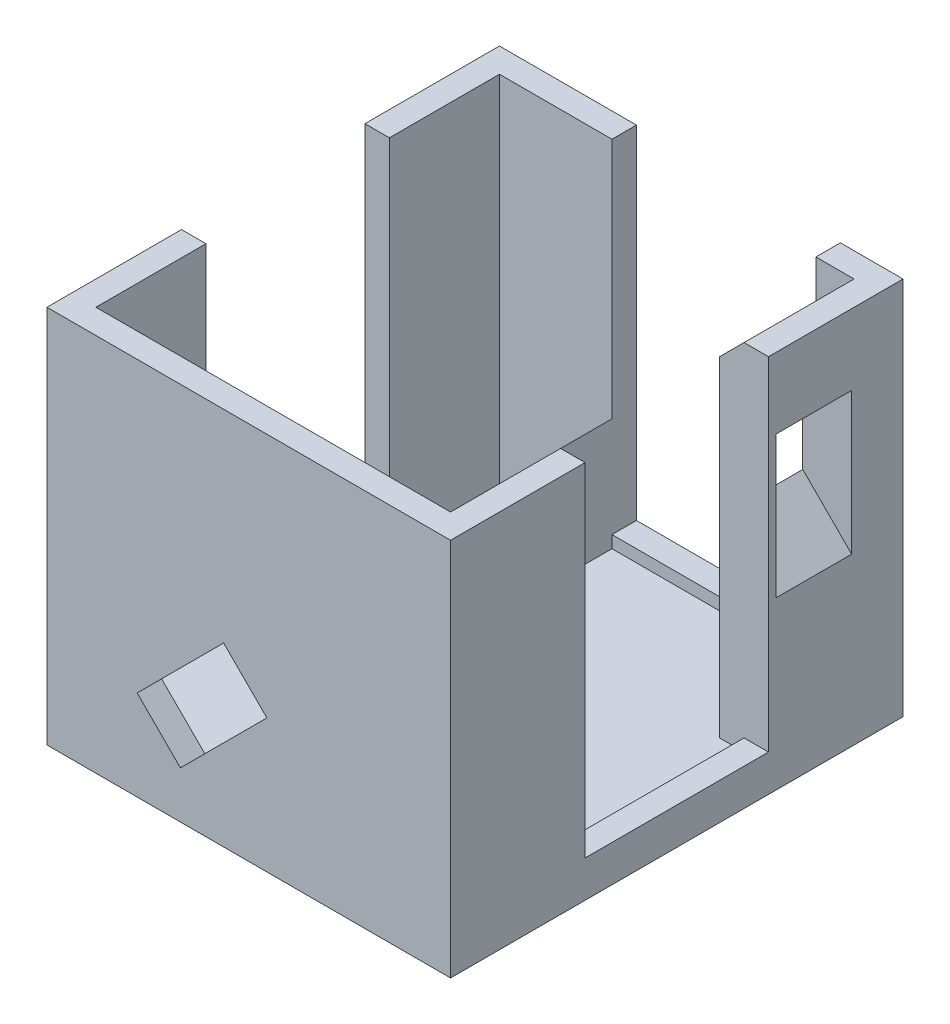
ISO-10303-21;
HEADER;
FILE_DESCRIPTION(('STEP AP214'),'2;1');
FILE_NAME('part.step','',(''),(''),'','','');
FILE_SCHEMA(('AUTOMOTIVE_DESIGN { 1 0 10303 214 1 1 1 1 }'));
ENDSEC;
DATA;
#1=APPLICATION_CONTEXT('core data for automotive mechanical design processes');
#2=APPLICATION_PROTOCOL_DEFINITION('international standard','automotive_design',2000,#1);
#3=PRODUCT_CONTEXT('',#1,'mechanical');
#4=PRODUCT('Part','Part','',(#3));
#5=PRODUCT_RELATED_PRODUCT_CATEGORY('part','',(#4));
#6=PRODUCT_DEFINITION_FORMATION('','',#4);
#7=PRODUCT_DEFINITION_CONTEXT('part definition',#1,'design');
#8=PRODUCT_DEFINITION('design','',#6,#7);
#9=PRODUCT_DEFINITION_SHAPE('','',#8);
#10=(LENGTH_UNIT() NAMED_UNIT(*) SI_UNIT(.MILLI.,.METRE.));
#11=(NAMED_UNIT(*) PLANE_ANGLE_UNIT() SI_UNIT($,.RADIAN.));
#12=(NAMED_UNIT(*) SI_UNIT($,.STERADIAN.) SOLID_ANGLE_UNIT());
#13=UNCERTAINTY_MEASURE_WITH_UNIT(LENGTH_MEASURE(1.E-05),#10,'distance_accuracy_value','');
#14=(GEOMETRIC_REPRESENTATION_CONTEXT(3) GLOBAL_UNCERTAINTY_ASSIGNED_CONTEXT((#13)) GLOBAL_UNIT_ASSIGNED_CONTEXT((#10,
#11,#12)) REPRESENTATION_CONTEXT('',''));
#15=CARTESIAN_POINT('',(0.,0.,0.));
#16=DIRECTION('',(0.,0.,1.));
#17=DIRECTION('',(1.,0.,0.));
#18=AXIS2_PLACEMENT_3D('',#15,#16,#17);
#19=CARTESIAN_POINT('',(0.,58.,0.));
#20=DIRECTION('',(0.,1.,0.));
#21=DIRECTION('',(0.,0.,1.));
#22=AXIS2_PLACEMENT_3D('',#19,#20,#21);
#23=PLANE('',#22);
#24=DIRECTION('',(0.,0.,1.));
#25=VECTOR('',#24,1.);
#26=CARTESIAN_POINT('',(-10.6,58.,-33.));
#27=LINE('',#26,#25);
#28=CARTESIAN_POINT('',(-10.6,58.,-37.));
#29=VERTEX_POINT('',#28);
#30=CARTESIAN_POINT('',(-10.6,58.,-33.));
#31=VERTEX_POINT('',#30);
#32=EDGE_CURVE('E646',#29,#31,#27,.T.);
#33=ORIENTED_EDGE('',*,*,#32,.F.);
#34=DIRECTION('',(-1.,0.,0.));
#35=VECTOR('',#34,1.);
#36=CARTESIAN_POINT('',(-33.,58.,-37.));
#37=LINE('',#36,#35);
#38=CARTESIAN_POINT('',(-33.,58.,-37.));
#39=VERTEX_POINT('',#38);
#40=EDGE_CURVE('E542',#29,#39,#37,.T.);
#41=ORIENTED_EDGE('',*,*,#40,.T.);
#42=DIRECTION('',(0.,0.,1.));
#43=VECTOR('',#42,1.);
#44=CARTESIAN_POINT('',(-33.,58.,-37.));
#45=LINE('',#44,#43);
#46=CARTESIAN_POINT('',(-33.,58.,-15.));
#47=VERTEX_POINT('',#46);
#48=EDGE_CURVE('E548',#39,#47,#45,.T.);
#49=ORIENTED_EDGE('',*,*,#48,.T.);
#50=DIRECTION('',(-1.,0.,0.));
#51=VECTOR('',#50,1.);
#52=CARTESIAN_POINT('',(-29.,58.,-15.));
#53=LINE('',#52,#51);
#54=CARTESIAN_POINT('',(-29.,58.,-15.));
#55=VERTEX_POINT('',#54);
#56=EDGE_CURVE('E690',#55,#47,#53,.T.);
#57=ORIENTED_EDGE('',*,*,#56,.F.);
#58=DIRECTION('',(0.,0.,1.));
#59=VECTOR('',#58,1.);
#60=CARTESIAN_POINT('',(-29.,58.,-33.));
#61=LINE('',#60,#59);
#62=CARTESIAN_POINT('',(-29.,58.,-33.));
#63=VERTEX_POINT('',#62);
#64=EDGE_CURVE('E518',#63,#55,#61,.T.);
#65=ORIENTED_EDGE('',*,*,#64,.F.);
#66=DIRECTION('',(-1.,0.,0.));
#67=VECTOR('',#66,1.);
#68=CARTESIAN_POINT('',(-29.,58.,-33.));
#69=LINE('',#68,#67);
#70=EDGE_CURVE('E512',#31,#63,#69,.T.);
#71=ORIENTED_EDGE('',*,*,#70,.F.);
#72=EDGE_LOOP('',(#33,#41,#49,#57,#65,#71));
#73=FACE_BOUND('',#72,.T.);
#74=ADVANCED_FACE('F45',(#73),#23,.T.);
#75=CARTESIAN_POINT('',(-29.,58.,-33.));
#76=DIRECTION('',(0.,0.,1.));
#77=DIRECTION('',(1.,0.,0.));
#78=AXIS2_PLACEMENT_3D('',#75,#76,#77);
#79=PLANE('',#78);
#80=DIRECTION('',(0.,1.,0.));
#81=VECTOR('',#80,1.);
#82=CARTESIAN_POINT('',(-10.6,2.,-33.));
#83=LINE('',#82,#81);
#84=CARTESIAN_POINT('',(-10.6,18.4000000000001,-33.));
#85=VERTEX_POINT('',#84);
#86=EDGE_CURVE('E817',#85,#31,#83,.T.);
#87=ORIENTED_EDGE('',*,*,#86,.T.);
#88=ORIENTED_EDGE('',*,*,#70,.T.);
#89=DIRECTION('',(0.,-1.,0.));
#90=VECTOR('',#89,1.);
#91=CARTESIAN_POINT('',(-29.,58.,-33.));
#92=LINE('',#91,#90);
#93=CARTESIAN_POINT('',(-29.,0.,-33.));
#94=VERTEX_POINT('',#93);
#95=EDGE_CURVE('E533',#63,#94,#92,.T.);
#96=ORIENTED_EDGE('',*,*,#95,.T.);
#97=DIRECTION('',(-0.707106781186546,-0.707106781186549,0.));
#98=VECTOR('',#97,1.);
#99=CARTESIAN_POINT('',(-29.,0.,-33.));
#100=LINE('',#99,#98);
#101=EDGE_CURVE('E480',#85,#94,#100,.T.);
#102=ORIENTED_EDGE('',*,*,#101,.F.);
#103=EDGE_LOOP('',(#87,#88,#96,#102));
#104=FACE_BOUND('',#103,.T.);
#105=ADVANCED_FACE('F615',(#104),#79,.T.);
#106=CARTESIAN_POINT('',(0.,-4.,0.));
#107=DIRECTION('',(0.,1.,0.));
#108=DIRECTION('',(0.,0.,1.));
#109=AXIS2_PLACEMENT_3D('',#106,#107,#108);
#110=PLANE('',#109);
#111=DIRECTION('',(0.,0.,1.));
#112=VECTOR('',#111,1.);
#113=CARTESIAN_POINT('',(33.,-4.,-37.));
#114=LINE('',#113,#112);
#115=CARTESIAN_POINT('',(33.,-4.,-37.));
#116=VERTEX_POINT('',#115);
#117=CARTESIAN_POINT('',(33.,-4.,37.));
#118=VERTEX_POINT('',#117);
#119=EDGE_CURVE('E490',#116,#118,#114,.T.);
#120=ORIENTED_EDGE('',*,*,#119,.T.);
#121=DIRECTION('',(-1.,0.,0.));
#122=VECTOR('',#121,1.);
#123=CARTESIAN_POINT('',(-33.,-4.,37.));
#124=LINE('',#123,#122);
#125=CARTESIAN_POINT('',(-33.,-4.,37.));
#126=VERTEX_POINT('',#125);
#127=EDGE_CURVE('E495',#118,#126,#124,.T.);
#128=ORIENTED_EDGE('',*,*,#127,.T.);
#129=DIRECTION('',(0.,0.,-1.));
#130=VECTOR('',#129,1.);
#131=CARTESIAN_POINT('',(-33.,-4.,-37.));
#132=LINE('',#131,#130);
#133=CARTESIAN_POINT('',(-33.,-4.,-37.));
#134=VERTEX_POINT('',#133);
#135=EDGE_CURVE('E499',#126,#134,#132,.T.);
#136=ORIENTED_EDGE('',*,*,#135,.T.);
#137=DIRECTION('',(1.,0.,0.));
#138=VECTOR('',#137,1.);
#139=CARTESIAN_POINT('',(-33.,-4.,-37.));
#140=LINE('',#139,#138);
#141=EDGE_CURVE('E503',#134,#116,#140,.T.);
#142=ORIENTED_EDGE('',*,*,#141,.T.);
#143=EDGE_LOOP('',(#120,#128,#136,#142));
#144=FACE_BOUND('',#143,.T.);
#145=CARTESIAN_POINT('',(0.,-4.,0.));
#146=DIRECTION('',(0.,1.,0.));
#147=DIRECTION('',(0.,0.,1.));
#148=AXIS2_PLACEMENT_3D('',#145,#146,#147);
#149=CIRCLE('',#148,2.75);
#150=CARTESIAN_POINT('',(2.23,-4.,-1.60922341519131));
#151=VERTEX_POINT('',#150);
#152=CARTESIAN_POINT('',(2.23,-4.,1.60922341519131));
#153=VERTEX_POINT('',#152);
#154=EDGE_CURVE('E61',#151,#153,#149,.T.);
#155=ORIENTED_EDGE('',*,*,#154,.T.);
#156=DIRECTION('',(0.,0.,-1.));
#157=VECTOR('',#156,1.);
#158=CARTESIAN_POINT('',(2.23,-4.,1.60922341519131));
#159=LINE('',#158,#157);
#160=EDGE_CURVE('E810',#153,#151,#159,.T.);
#161=ORIENTED_EDGE('',*,*,#160,.T.);
#162=EDGE_LOOP('',(#155,#161));
#163=FACE_BOUND('',#162,.T.);
#164=ADVANCED_FACE('F621',(#144,#163),#110,.F.);
#165=CARTESIAN_POINT('',(0.,18.4,0.));
#166=DIRECTION('',(0.,1.,0.));
#167=DIRECTION('',(0.,0.,1.));
#168=AXIS2_PLACEMENT_3D('',#165,#166,#167);
#169=PLANE('',#168);
#170=CARTESIAN_POINT('',(0.,18.4,0.));
#171=DIRECTION('',(0.,1.,0.));
#172=DIRECTION('',(0.,0.,1.));
#173=AXIS2_PLACEMENT_3D('',#170,#171,#172);
#174=CIRCLE('',#173,10.);
#175=CARTESIAN_POINT('',(0.,18.4,10.));
#176=VERTEX_POINT('',#175);
#177=EDGE_CURVE('E772',#176,#176,#174,.T.);
#178=ORIENTED_EDGE('',*,*,#177,.T.);
#179=EDGE_LOOP('',(#178));
#180=FACE_BOUND('',#179,.T.);
#181=DIRECTION('',(0.,0.,-1.));
#182=VECTOR('',#181,1.);
#183=CARTESIAN_POINT('',(2.23,18.4,1.60922341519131));
#184=LINE('',#183,#182);
#185=CARTESIAN_POINT('',(2.23,18.4,1.60922341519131));
#186=VERTEX_POINT('',#185);
#187=CARTESIAN_POINT('',(2.23,18.4,-1.60922341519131));
#188=VERTEX_POINT('',#187);
#189=EDGE_CURVE('E802',#186,#188,#184,.T.);
#190=ORIENTED_EDGE('',*,*,#189,.F.);
#191=CARTESIAN_POINT('',(0.,18.4,0.));
#192=DIRECTION('',(0.,1.,0.));
#193=DIRECTION('',(0.,0.,1.));
#194=AXIS2_PLACEMENT_3D('',#191,#192,#193);
#195=CIRCLE('',#194,2.75);
#196=EDGE_CURVE('E807',#188,#186,#195,.T.);
#197=ORIENTED_EDGE('',*,*,#196,.F.);
#198=EDGE_LOOP('',(#190,#197));
#199=FACE_BOUND('',#198,.T.);
#200=ADVANCED_FACE('F628',(#180,#199),#169,.T.);
#201=DIRECTION('',(0.,0.,-1.));
#202=VECTOR('',#201,1.);
#203=CARTESIAN_POINT('',(22.7548995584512,58.,-33.));
#204=LINE('',#203,#202);
#205=CARTESIAN_POINT('',(22.7548995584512,58.,-33.));
#206=VERTEX_POINT('',#205);
#207=CARTESIAN_POINT('',(22.7548995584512,58.,-37.));
#208=VERTEX_POINT('',#207);
#209=EDGE_CURVE('E316',#206,#208,#204,.T.);
#210=ORIENTED_EDGE('',*,*,#209,.F.);
#211=CARTESIAN_POINT('',(29.,58.,-33.));
#212=VERTEX_POINT('',#211);
#213=EDGE_CURVE('E514',#212,#206,#69,.T.);
#214=ORIENTED_EDGE('',*,*,#213,.F.);
#215=DIRECTION('',(0.,0.,-1.));
#216=VECTOR('',#215,1.);
#217=CARTESIAN_POINT('',(29.,58.,-33.));
#218=LINE('',#217,#216);
#219=CARTESIAN_POINT('',(29.,58.,-15.));
#220=VERTEX_POINT('',#219);
#221=EDGE_CURVE('E513',#220,#212,#218,.T.);
#222=ORIENTED_EDGE('',*,*,#221,.F.);
#223=DIRECTION('',(-1.,0.,0.));
#224=VECTOR('',#223,1.);
#225=CARTESIAN_POINT('',(29.,58.,-15.));
#226=LINE('',#225,#224);
#227=CARTESIAN_POINT('',(33.,58.,-15.));
#228=VERTEX_POINT('',#227);
#229=EDGE_CURVE('E767',#228,#220,#226,.T.);
#230=ORIENTED_EDGE('',*,*,#229,.F.);
#231=DIRECTION('',(0.,0.,-1.));
#232=VECTOR('',#231,1.);
#233=CARTESIAN_POINT('',(33.,58.,-37.));
#234=LINE('',#233,#232);
#235=CARTESIAN_POINT('',(33.,58.,-37.));
#236=VERTEX_POINT('',#235);
#237=EDGE_CURVE('E537',#228,#236,#234,.T.);
#238=ORIENTED_EDGE('',*,*,#237,.T.);
#239=EDGE_CURVE('E543',#236,#208,#37,.T.);
#240=ORIENTED_EDGE('',*,*,#239,.T.);
#241=EDGE_LOOP('',(#210,#214,#222,#230,#238,#240));
#242=FACE_BOUND('',#241,.T.);
#243=ADVANCED_FACE('F612',(#242),#23,.T.);
#244=CARTESIAN_POINT('',(-29.,0.,-33.));
#245=DIRECTION('',(-0.707106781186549,0.707106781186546,0.));
#246=DIRECTION('',(-0.707106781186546,-0.707106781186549,0.));
#247=AXIS2_PLACEMENT_3D('',#244,#245,#246);
#248=PLANE('',#247);
#249=DIRECTION('',(0.,0.,-1.));
#250=VECTOR('',#249,1.);
#251=CARTESIAN_POINT('',(-26.2,2.8,-33.));
#252=LINE('',#251,#250);
#253=CARTESIAN_POINT('',(-26.2,2.8,33.));
#254=VERTEX_POINT('',#253);
#255=CARTESIAN_POINT('',(-26.2,2.8,27.));
#256=VERTEX_POINT('',#255);
#257=EDGE_CURVE('E385',#254,#256,#252,.T.);
#258=ORIENTED_EDGE('',*,*,#257,.T.);
#259=DIRECTION('',(-0.707106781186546,-0.707106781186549,0.));
#260=VECTOR('',#259,1.);
#261=CARTESIAN_POINT('',(-29.,0.,27.));
#262=LINE('',#261,#260);
#263=CARTESIAN_POINT('',(-29.,0.,27.));
#264=VERTEX_POINT('',#263);
#265=EDGE_CURVE('E393',#256,#264,#262,.T.);
#266=ORIENTED_EDGE('',*,*,#265,.T.);
#267=DIRECTION('',(0.,0.,1.));
#268=VECTOR('',#267,1.);
#269=CARTESIAN_POINT('',(-29.,0.,-33.));
#270=LINE('',#269,#268);
#271=CARTESIAN_POINT('',(-29.,0.,33.));
#272=VERTEX_POINT('',#271);
#273=EDGE_CURVE('E507',#264,#272,#270,.T.);
#274=ORIENTED_EDGE('',*,*,#273,.T.);
#275=DIRECTION('',(0.707106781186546,0.707106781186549,0.));
#276=VECTOR('',#275,1.);
#277=CARTESIAN_POINT('',(0.,29.0000000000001,33.));
#278=LINE('',#277,#276);
#279=EDGE_CURVE('E486',#272,#254,#278,.T.);
#280=ORIENTED_EDGE('',*,*,#279,.T.);
#281=EDGE_LOOP('',(#258,#266,#274,#280));
#282=FACE_BOUND('',#281,.T.);
#283=ADVANCED_FACE('F627',(#282),#248,.T.);
#284=CARTESIAN_POINT('',(25.,54.0000000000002,-33.));
#285=VERTEX_POINT('',#284);
#286=EDGE_CURVE('E481',#212,#285,#100,.T.);
#287=ORIENTED_EDGE('',*,*,#286,.T.);
#288=DIRECTION('',(0.,0.,1.));
#289=VECTOR('',#288,1.);
#290=CARTESIAN_POINT('',(25.,54.0000000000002,-33.));
#291=LINE('',#290,#289);
#292=CARTESIAN_POINT('',(25.,54.0000000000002,-28.6));
#293=VERTEX_POINT('',#292);
#294=EDGE_CURVE('E381',#285,#293,#291,.T.);
#295=ORIENTED_EDGE('',*,*,#294,.T.);
#296=DIRECTION('',(-0.707106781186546,-0.707106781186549,0.));
#297=VECTOR('',#296,1.);
#298=CARTESIAN_POINT('',(25.2106282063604,54.2106282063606,-28.6));
#299=LINE('',#298,#297);
#300=CARTESIAN_POINT('',(25.2106282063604,54.2106282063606,-28.6));
#301=VERTEX_POINT('',#300);
#302=EDGE_CURVE('E445',#301,#293,#299,.T.);
#303=ORIENTED_EDGE('',*,*,#302,.F.);
#304=DIRECTION('',(0.,0.,-1.));
#305=VECTOR('',#304,1.);
#306=CARTESIAN_POINT('',(25.2106282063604,54.2106282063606,-28.6));
#307=LINE('',#306,#305);
#308=CARTESIAN_POINT('',(25.2106282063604,54.2106282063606,-16.2));
#309=VERTEX_POINT('',#308);
#310=EDGE_CURVE('E441',#309,#301,#307,.T.);
#311=ORIENTED_EDGE('',*,*,#310,.F.);
#312=DIRECTION('',(0.707106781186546,0.707106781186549,0.));
#313=VECTOR('',#312,1.);
#314=CARTESIAN_POINT('',(25.2106282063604,54.2106282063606,-16.2));
#315=LINE('',#314,#313);
#316=CARTESIAN_POINT('',(25.,54.0000000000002,-16.2));
#317=VERTEX_POINT('',#316);
#318=EDGE_CURVE('E438',#317,#309,#315,.T.);
#319=ORIENTED_EDGE('',*,*,#318,.F.);
#320=CARTESIAN_POINT('',(25.,54.0000000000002,-15.));
#321=VERTEX_POINT('',#320);
#322=EDGE_CURVE('E377',#317,#321,#291,.T.);
#323=ORIENTED_EDGE('',*,*,#322,.T.);
#324=DIRECTION('',(0.707106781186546,0.707106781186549,0.));
#325=VECTOR('',#324,1.);
#326=CARTESIAN_POINT('',(-29.,0.,-15.));
#327=LINE('',#326,#325);
#328=EDGE_CURVE('E401',#321,#220,#327,.T.);
#329=ORIENTED_EDGE('',*,*,#328,.T.);
#330=ORIENTED_EDGE('',*,*,#221,.T.);
#331=EDGE_LOOP('',(#287,#295,#303,#311,#319,#323,#329,#330));
#332=FACE_BOUND('',#331,.T.);
#333=ADVANCED_FACE('F580',(#332),#248,.T.);
#334=DIRECTION('',(0.707106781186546,0.707106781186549,0.));
#335=VECTOR('',#334,1.);
#336=CARTESIAN_POINT('',(-29.,0.,-21.));
#337=LINE('',#336,#335);
#338=CARTESIAN_POINT('',(-29.,0.,-21.));
#339=VERTEX_POINT('',#338);
#340=CARTESIAN_POINT('',(-10.6,18.4000000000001,-21.));
#341=VERTEX_POINT('',#340);
#342=EDGE_CURVE('E389',#339,#341,#337,.T.);
#343=ORIENTED_EDGE('',*,*,#342,.T.);
#344=DIRECTION('',(0.,0.,-1.));
#345=VECTOR('',#344,1.);
#346=CARTESIAN_POINT('',(-10.6,18.4000000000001,-33.));
#347=LINE('',#346,#345);
#348=EDGE_CURVE('E397',#341,#85,#347,.T.);
#349=ORIENTED_EDGE('',*,*,#348,.T.);
#350=ORIENTED_EDGE('',*,*,#101,.T.);
#351=EDGE_CURVE('E526',#94,#339,#270,.T.);
#352=ORIENTED_EDGE('',*,*,#351,.T.);
#353=EDGE_LOOP('',(#343,#349,#350,#352));
#354=FACE_BOUND('',#353,.T.);
#355=ADVANCED_FACE('F683',(#354),#248,.T.);
#356=CARTESIAN_POINT('',(46.4238316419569,32.9974247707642,-16.2));
#357=DIRECTION('',(0.,0.,1.));
#358=DIRECTION('',(0.,-1.,0.));
#359=AXIS2_PLACEMENT_3D('',#356,#357,#358);
#360=PLANE('',#359);
#361=DIRECTION('',(0.,-1.,0.));
#362=VECTOR('',#361,1.);
#363=CARTESIAN_POINT('',(25.,32.9974247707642,-16.2));
#364=LINE('',#363,#362);
#365=CARTESIAN_POINT('',(25.,31.2281539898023,-16.2));
#366=VERTEX_POINT('',#365);
#367=EDGE_CURVE('E374',#317,#366,#364,.T.);
#368=ORIENTED_EDGE('',*,*,#367,.F.);
#369=ORIENTED_EDGE('',*,*,#318,.T.);
#370=DIRECTION('',(-0.707106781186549,0.707106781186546,0.));
#371=VECTOR('',#370,1.);
#372=CARTESIAN_POINT('',(46.4238316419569,32.9974247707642,-16.2));
#373=LINE('',#372,#371);
#374=CARTESIAN_POINT('',(33.,46.421256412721,-16.2));
#375=VERTEX_POINT('',#374);
#376=EDGE_CURVE('E449',#375,#309,#373,.T.);
#377=ORIENTED_EDGE('',*,*,#376,.F.);
#378=DIRECTION('',(0.,1.,0.));
#379=VECTOR('',#378,1.);
#380=CARTESIAN_POINT('',(33.,58.,-16.2));
#381=LINE('',#380,#379);
#382=CARTESIAN_POINT('',(33.,23.2281539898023,-16.2));
#383=VERTEX_POINT('',#382);
#384=EDGE_CURVE('E476',#383,#375,#381,.T.);
#385=ORIENTED_EDGE('',*,*,#384,.F.);
#386=DIRECTION('',(-0.707106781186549,0.707106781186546,0.));
#387=VECTOR('',#386,1.);
#388=CARTESIAN_POINT('',(34.8272804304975,21.4008735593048,-16.2));
#389=LINE('',#388,#387);
#390=EDGE_CURVE('E450',#383,#366,#389,.T.);
#391=ORIENTED_EDGE('',*,*,#390,.T.);
#392=EDGE_LOOP('',(#368,#369,#377,#385,#391));
#393=FACE_BOUND('',#392,.T.);
#394=ADVANCED_FACE('F592',(#393),#360,.F.);
#395=CARTESIAN_POINT('',(34.8272804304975,21.4008735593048,-28.6));
#396=DIRECTION('',(-0.707106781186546,-0.707106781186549,0.));
#397=DIRECTION('',(0.707106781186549,-0.707106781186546,0.));
#398=AXIS2_PLACEMENT_3D('',#395,#396,#397);
#399=PLANE('',#398);
#400=DIRECTION('',(0.,0.,-1.));
#401=VECTOR('',#400,1.);
#402=CARTESIAN_POINT('',(25.,31.2281539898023,-28.6));
#403=LINE('',#402,#401);
#404=CARTESIAN_POINT('',(25.,31.2281539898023,-28.6));
#405=VERTEX_POINT('',#404);
#406=EDGE_CURVE('E371',#366,#405,#403,.T.);
#407=ORIENTED_EDGE('',*,*,#406,.F.);
#408=ORIENTED_EDGE('',*,*,#390,.F.);
#409=DIRECTION('',(0.,0.,1.));
#410=VECTOR('',#409,1.);
#411=CARTESIAN_POINT('',(33.,23.2281539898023,-37.));
#412=LINE('',#411,#410);
#413=CARTESIAN_POINT('',(33.,23.2281539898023,-28.6));
#414=VERTEX_POINT('',#413);
#415=EDGE_CURVE('E472',#414,#383,#412,.T.);
#416=ORIENTED_EDGE('',*,*,#415,.F.);
#417=DIRECTION('',(-0.707106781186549,0.707106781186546,0.));
#418=VECTOR('',#417,1.);
#419=CARTESIAN_POINT('',(34.8272804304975,21.4008735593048,-28.6));
#420=LINE('',#419,#418);
#421=EDGE_CURVE('E455',#414,#405,#420,.T.);
#422=ORIENTED_EDGE('',*,*,#421,.T.);
#423=EDGE_LOOP('',(#407,#408,#416,#422));
#424=FACE_BOUND('',#423,.T.);
#425=ADVANCED_FACE('F596',(#424),#399,.F.);
#426=CARTESIAN_POINT('',(46.4238316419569,32.9974247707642,-28.6));
#427=DIRECTION('',(0.,0.,-1.));
#428=DIRECTION('',(0.,1.,0.));
#429=AXIS2_PLACEMENT_3D('',#426,#427,#428);
#430=PLANE('',#429);
#431=DIRECTION('',(0.,1.,0.));
#432=VECTOR('',#431,1.);
#433=CARTESIAN_POINT('',(25.,32.9974247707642,-28.6));
#434=LINE('',#433,#432);
#435=EDGE_CURVE('E54',#405,#293,#434,.T.);
#436=ORIENTED_EDGE('',*,*,#435,.F.);
#437=ORIENTED_EDGE('',*,*,#421,.F.);
#438=DIRECTION('',(0.,-1.,0.));
#439=VECTOR('',#438,1.);
#440=CARTESIAN_POINT('',(33.,58.,-28.6));
#441=LINE('',#440,#439);
#442=CARTESIAN_POINT('',(33.,46.421256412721,-28.6));
#443=VERTEX_POINT('',#442);
#444=EDGE_CURVE('E468',#443,#414,#441,.T.);
#445=ORIENTED_EDGE('',*,*,#444,.F.);
#446=DIRECTION('',(-0.707106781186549,0.707106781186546,0.));
#447=VECTOR('',#446,1.);
#448=CARTESIAN_POINT('',(46.4238316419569,32.9974247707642,-28.6));
#449=LINE('',#448,#447);
#450=EDGE_CURVE('E459',#443,#301,#449,.T.);
#451=ORIENTED_EDGE('',*,*,#450,.T.);
#452=ORIENTED_EDGE('',*,*,#302,.T.);
#453=EDGE_LOOP('',(#436,#437,#445,#451,#452));
#454=FACE_BOUND('',#453,.T.);
#455=ADVANCED_FACE('F584',(#454),#430,.F.);
#456=CARTESIAN_POINT('',(-33.,58.,37.));
#457=DIRECTION('',(0.,0.,-1.));
#458=DIRECTION('',(-1.,0.,0.));
#459=AXIS2_PLACEMENT_3D('',#456,#457,#458);
#460=PLANE('',#459);
#461=DIRECTION('',(0.,-1.,0.));
#462=VECTOR('',#461,1.);
#463=CARTESIAN_POINT('',(33.,58.,37.));
#464=LINE('',#463,#462);
#465=CARTESIAN_POINT('',(33.,58.,37.));
#466=VERTEX_POINT('',#465);
#467=EDGE_CURVE('E555',#466,#118,#464,.T.);
#468=ORIENTED_EDGE('',*,*,#467,.F.);
#469=DIRECTION('',(1.,0.,0.));
#470=VECTOR('',#469,1.);
#471=CARTESIAN_POINT('',(-33.,58.,37.));
#472=LINE('',#471,#470);
#473=CARTESIAN_POINT('',(-33.,58.,37.));
#474=VERTEX_POINT('',#473);
#475=EDGE_CURVE('E552',#474,#466,#472,.T.);
#476=ORIENTED_EDGE('',*,*,#475,.F.);
#477=DIRECTION('',(0.,-1.,0.));
#478=VECTOR('',#477,1.);
#479=CARTESIAN_POINT('',(-33.,58.,37.));
#480=LINE('',#479,#478);
#481=EDGE_CURVE('E558',#474,#126,#480,.T.);
#482=ORIENTED_EDGE('',*,*,#481,.T.);
#483=ORIENTED_EDGE('',*,*,#127,.F.);
#484=EDGE_LOOP('',(#468,#476,#482,#483));
#485=FACE_BOUND('',#484,.T.);
#486=DIRECTION('',(0.707106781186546,0.707106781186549,0.));
#487=VECTOR('',#486,1.);
#488=CARTESIAN_POINT('',(-18.2519769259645,10.7480230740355,37.));
#489=LINE('',#488,#487);
#490=CARTESIAN_POINT('',(-18.2519769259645,10.7480230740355,37.));
#491=VERTEX_POINT('',#490);
#492=CARTESIAN_POINT('',(-4.10984130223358,24.8901586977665,37.));
#493=VERTEX_POINT('',#492);
#494=EDGE_CURVE('E409',#491,#493,#489,.T.);
#495=ORIENTED_EDGE('',*,*,#494,.T.);
#496=DIRECTION('',(0.707106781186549,-0.707106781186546,0.));
#497=VECTOR('',#496,1.);
#498=CARTESIAN_POINT('',(-4.10984130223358,24.8901586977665,37.));
#499=LINE('',#498,#497);
#500=CARTESIAN_POINT('',(2.96122650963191,17.8190908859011,37.));
#501=VERTEX_POINT('',#500);
#502=EDGE_CURVE('E413',#493,#501,#499,.T.);
#503=ORIENTED_EDGE('',*,*,#502,.T.);
#504=DIRECTION('',(0.707106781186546,0.707106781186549,0.));
#505=VECTOR('',#504,1.);
#506=CARTESIAN_POINT('',(-11.1809091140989,3.67695526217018,37.));
#507=LINE('',#506,#505);
#508=CARTESIAN_POINT('',(-11.1809091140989,3.67695526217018,37.));
#509=VERTEX_POINT('',#508);
#510=EDGE_CURVE('E417',#509,#501,#507,.T.);
#511=ORIENTED_EDGE('',*,*,#510,.F.);
#512=DIRECTION('',(0.707106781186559,-0.707106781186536,0.));
#513=VECTOR('',#512,1.);
#514=CARTESIAN_POINT('',(-18.2519769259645,10.7480230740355,37.));
#515=LINE('',#514,#513);
#516=EDGE_CURVE('E421',#491,#509,#515,.T.);
#517=ORIENTED_EDGE('',*,*,#516,.F.);
#518=EDGE_LOOP('',(#495,#503,#511,#517));
#519=FACE_BOUND('',#518,.T.);
#520=ADVANCED_FACE('F843',(#485,#519),#460,.F.);
#521=DIRECTION('',(0.,0.,-1.));
#522=VECTOR('',#521,1.);
#523=CARTESIAN_POINT('',(25.,54.0000000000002,-33.));
#524=LINE('',#523,#522);
#525=CARTESIAN_POINT('',(25.,54.0000000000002,33.));
#526=VERTEX_POINT('',#525);
#527=CARTESIAN_POINT('',(25.,54.0000000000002,15.));
#528=VERTEX_POINT('',#527);
#529=EDGE_CURVE('E382',#526,#528,#524,.T.);
#530=ORIENTED_EDGE('',*,*,#529,.F.);
#531=CARTESIAN_POINT('',(29.,58.,33.));
#532=VERTEX_POINT('',#531);
#533=EDGE_CURVE('E485',#526,#532,#278,.T.);
#534=ORIENTED_EDGE('',*,*,#533,.T.);
#535=CARTESIAN_POINT('',(29.,58.,15.));
#536=VERTEX_POINT('',#535);
#537=EDGE_CURVE('E508',#532,#536,#218,.T.);
#538=ORIENTED_EDGE('',*,*,#537,.T.);
#539=DIRECTION('',(0.707106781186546,0.707106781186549,0.));
#540=VECTOR('',#539,1.);
#541=CARTESIAN_POINT('',(-29.,0.,15.));
#542=LINE('',#541,#540);
#543=EDGE_CURVE('E405',#528,#536,#542,.T.);
#544=ORIENTED_EDGE('',*,*,#543,.F.);
#545=EDGE_LOOP('',(#530,#534,#538,#544));
#546=FACE_BOUND('',#545,.T.);
#547=ADVANCED_FACE('F609',(#546),#248,.T.);
#548=DIRECTION('',(1.,0.,0.));
#549=VECTOR('',#548,1.);
#550=CARTESIAN_POINT('',(33.,58.,15.));
#551=LINE('',#550,#549);
#552=CARTESIAN_POINT('',(33.,58.,15.));
#553=VERTEX_POINT('',#552);
#554=EDGE_CURVE('E700',#536,#553,#551,.T.);
#555=ORIENTED_EDGE('',*,*,#554,.F.);
#556=ORIENTED_EDGE('',*,*,#537,.F.);
#557=DIRECTION('',(1.,0.,0.));
#558=VECTOR('',#557,1.);
#559=CARTESIAN_POINT('',(-29.,58.,33.));
#560=LINE('',#559,#558);
#561=CARTESIAN_POINT('',(-29.,58.,33.));
#562=VERTEX_POINT('',#561);
#563=EDGE_CURVE('E522',#562,#532,#560,.T.);
#564=ORIENTED_EDGE('',*,*,#563,.F.);
#565=CARTESIAN_POINT('',(-29.,58.,15.));
#566=VERTEX_POINT('',#565);
#567=EDGE_CURVE('E517',#566,#562,#61,.T.);
#568=ORIENTED_EDGE('',*,*,#567,.F.);
#569=DIRECTION('',(1.,0.,0.));
#570=VECTOR('',#569,1.);
#571=CARTESIAN_POINT('',(-33.,58.,15.));
#572=LINE('',#571,#570);
#573=CARTESIAN_POINT('',(-33.,58.,15.));
#574=VERTEX_POINT('',#573);
#575=EDGE_CURVE('E695',#574,#566,#572,.T.);
#576=ORIENTED_EDGE('',*,*,#575,.F.);
#577=EDGE_CURVE('E547',#574,#474,#45,.T.);
#578=ORIENTED_EDGE('',*,*,#577,.T.);
#579=ORIENTED_EDGE('',*,*,#475,.T.);
#580=EDGE_CURVE('E538',#466,#553,#234,.T.);
#581=ORIENTED_EDGE('',*,*,#580,.T.);
#582=EDGE_LOOP('',(#555,#556,#564,#568,#576,#578,#579,#581));
#583=FACE_BOUND('',#582,.T.);
#584=ADVANCED_FACE('F600',(#583),#23,.T.);
#585=CARTESIAN_POINT('',(33.,58.,-37.));
#586=DIRECTION('',(-1.,0.,0.));
#587=DIRECTION('',(0.,0.,1.));
#588=AXIS2_PLACEMENT_3D('',#585,#586,#587);
#589=PLANE('',#588);
#590=ORIENTED_EDGE('',*,*,#237,.F.);
#591=DIRECTION('',(0.,1.,0.));
#592=VECTOR('',#591,1.);
#593=CARTESIAN_POINT('',(33.,2.,-15.));
#594=LINE('',#593,#592);
#595=CARTESIAN_POINT('',(33.,2.,-15.));
#596=VERTEX_POINT('',#595);
#597=EDGE_CURVE('E723',#596,#228,#594,.T.);
#598=ORIENTED_EDGE('',*,*,#597,.F.);
#599=DIRECTION('',(0.,0.,-1.));
#600=VECTOR('',#599,1.);
#601=CARTESIAN_POINT('',(33.,2.,-15.));
#602=LINE('',#601,#600);
#603=CARTESIAN_POINT('',(33.,2.,15.));
#604=VERTEX_POINT('',#603);
#605=EDGE_CURVE('E760',#604,#596,#602,.T.);
#606=ORIENTED_EDGE('',*,*,#605,.F.);
#607=DIRECTION('',(0.,1.,0.));
#608=VECTOR('',#607,1.);
#609=CARTESIAN_POINT('',(33.,2.,15.));
#610=LINE('',#609,#608);
#611=EDGE_CURVE('E756',#604,#553,#610,.T.);
#612=ORIENTED_EDGE('',*,*,#611,.T.);
#613=ORIENTED_EDGE('',*,*,#580,.F.);
#614=ORIENTED_EDGE('',*,*,#467,.T.);
#615=ORIENTED_EDGE('',*,*,#119,.F.);
#616=DIRECTION('',(0.,-1.,0.));
#617=VECTOR('',#616,1.);
#618=CARTESIAN_POINT('',(33.,58.,-37.));
#619=LINE('',#618,#617);
#620=EDGE_CURVE('E564',#236,#116,#619,.T.);
#621=ORIENTED_EDGE('',*,*,#620,.F.);
#622=EDGE_LOOP('',(#590,#598,#606,#612,#613,#614,#615,#621));
#623=FACE_BOUND('',#622,.T.);
#624=ORIENTED_EDGE('',*,*,#415,.T.);
#625=ORIENTED_EDGE('',*,*,#384,.T.);
#626=DIRECTION('',(0.,0.,-1.));
#627=VECTOR('',#626,1.);
#628=CARTESIAN_POINT('',(33.,46.421256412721,-37.));
#629=LINE('',#628,#627);
#630=EDGE_CURVE('E454',#375,#443,#629,.T.);
#631=ORIENTED_EDGE('',*,*,#630,.T.);
#632=ORIENTED_EDGE('',*,*,#444,.T.);
#633=EDGE_LOOP('',(#624,#625,#631,#632));
#634=FACE_BOUND('',#633,.T.);
#635=ADVANCED_FACE('F47',(#623,#634),#589,.F.);
#636=CARTESIAN_POINT('',(-33.,58.,-37.));
#637=DIRECTION('',(0.,0.,1.));
#638=DIRECTION('',(1.,0.,0.));
#639=AXIS2_PLACEMENT_3D('',#636,#637,#638);
#640=PLANE('',#639);
#641=ORIENTED_EDGE('',*,*,#40,.F.);
#642=DIRECTION('',(0.,1.,0.));
#643=VECTOR('',#642,1.);
#644=CARTESIAN_POINT('',(-10.6,2.,-37.));
#645=LINE('',#644,#643);
#646=CARTESIAN_POINT('',(-10.6,2.,-37.));
#647=VERTEX_POINT('',#646);
#648=EDGE_CURVE('E816',#647,#29,#645,.T.);
#649=ORIENTED_EDGE('',*,*,#648,.F.);
#650=DIRECTION('',(-1.,0.,0.));
#651=VECTOR('',#650,1.);
#652=CARTESIAN_POINT('',(-10.6,2.,-37.));
#653=LINE('',#652,#651);
#654=CARTESIAN_POINT('',(22.7548995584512,2.,-37.));
#655=VERTEX_POINT('',#654);
#656=EDGE_CURVE('E311',#655,#647,#653,.T.);
#657=ORIENTED_EDGE('',*,*,#656,.F.);
#658=DIRECTION('',(0.,1.,0.));
#659=VECTOR('',#658,1.);
#660=CARTESIAN_POINT('',(22.7548995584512,2.,-37.));
#661=LINE('',#660,#659);
#662=EDGE_CURVE('E822',#655,#208,#661,.T.);
#663=ORIENTED_EDGE('',*,*,#662,.T.);
#664=ORIENTED_EDGE('',*,*,#239,.F.);
#665=ORIENTED_EDGE('',*,*,#620,.T.);
#666=ORIENTED_EDGE('',*,*,#141,.F.);
#667=DIRECTION('',(0.,-1.,0.));
#668=VECTOR('',#667,1.);
#669=CARTESIAN_POINT('',(-33.,58.,-37.));
#670=LINE('',#669,#668);
#671=EDGE_CURVE('E561',#39,#134,#670,.T.);
#672=ORIENTED_EDGE('',*,*,#671,.F.);
#673=EDGE_LOOP('',(#641,#649,#657,#663,#664,#665,#666,#672));
#674=FACE_BOUND('',#673,.T.);
#675=ADVANCED_FACE('F599',(#674),#640,.F.);
#676=CARTESIAN_POINT('',(-33.,58.,-37.));
#677=DIRECTION('',(1.,0.,0.));
#678=DIRECTION('',(0.,0.,-1.));
#679=AXIS2_PLACEMENT_3D('',#676,#677,#678);
#680=PLANE('',#679);
#681=DIRECTION('',(0.,0.,1.));
#682=VECTOR('',#681,1.);
#683=CARTESIAN_POINT('',(-33.,2.,-15.));
#684=LINE('',#683,#682);
#685=CARTESIAN_POINT('',(-33.,2.,-15.));
#686=VERTEX_POINT('',#685);
#687=CARTESIAN_POINT('',(-33.,2.,15.));
#688=VERTEX_POINT('',#687);
#689=EDGE_CURVE('E696',#686,#688,#684,.T.);
#690=ORIENTED_EDGE('',*,*,#689,.F.);
#691=DIRECTION('',(0.,1.,0.));
#692=VECTOR('',#691,1.);
#693=CARTESIAN_POINT('',(-33.,2.,-15.));
#694=LINE('',#693,#692);
#695=EDGE_CURVE('E706',#686,#47,#694,.T.);
#696=ORIENTED_EDGE('',*,*,#695,.T.);
#697=ORIENTED_EDGE('',*,*,#48,.F.);
#698=ORIENTED_EDGE('',*,*,#671,.T.);
#699=ORIENTED_EDGE('',*,*,#135,.F.);
#700=ORIENTED_EDGE('',*,*,#481,.F.);
#701=ORIENTED_EDGE('',*,*,#577,.F.);
#702=DIRECTION('',(0.,1.,0.));
#703=VECTOR('',#702,1.);
#704=CARTESIAN_POINT('',(-33.,2.,15.));
#705=LINE('',#704,#703);
#706=EDGE_CURVE('E714',#688,#574,#705,.T.);
#707=ORIENTED_EDGE('',*,*,#706,.F.);
#708=EDGE_LOOP('',(#690,#696,#697,#698,#699,#700,#701,#707));
#709=FACE_BOUND('',#708,.T.);
#710=ADVANCED_FACE('F607',(#709),#680,.F.);
#711=DIRECTION('',(0.,1.,0.));
#712=VECTOR('',#711,1.);
#713=CARTESIAN_POINT('',(22.7548995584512,2.,-33.));
#714=LINE('',#713,#712);
#715=CARTESIAN_POINT('',(22.7548995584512,2.,-33.));
#716=VERTEX_POINT('',#715);
#717=EDGE_CURVE('E324',#716,#206,#714,.T.);
#718=ORIENTED_EDGE('',*,*,#717,.F.);
#719=DIRECTION('',(1.,0.,0.));
#720=VECTOR('',#719,1.);
#721=CARTESIAN_POINT('',(-10.6,2.,-33.));
#722=LINE('',#721,#720);
#723=CARTESIAN_POINT('',(-10.6,2.,-33.));
#724=VERTEX_POINT('',#723);
#725=EDGE_CURVE('E308',#724,#716,#722,.T.);
#726=ORIENTED_EDGE('',*,*,#725,.F.);
#727=DIRECTION('',(0.,-1.,0.));
#728=VECTOR('',#727,1.);
#729=CARTESIAN_POINT('',(-10.6,70.,-33.));
#730=LINE('',#729,#728);
#731=CARTESIAN_POINT('',(-10.6,0.,-33.));
#732=VERTEX_POINT('',#731);
#733=EDGE_CURVE('E321',#724,#732,#730,.T.);
#734=ORIENTED_EDGE('',*,*,#733,.T.);
#735=DIRECTION('',(1.,0.,0.));
#736=VECTOR('',#735,1.);
#737=CARTESIAN_POINT('',(-10.6,0.,-33.));
#738=LINE('',#737,#736);
#739=CARTESIAN_POINT('',(25.,0.,-33.));
#740=VERTEX_POINT('',#739);
#741=EDGE_CURVE('E648',#732,#740,#738,.T.);
#742=ORIENTED_EDGE('',*,*,#741,.T.);
#743=DIRECTION('',(0.,-1.,0.));
#744=VECTOR('',#743,1.);
#745=CARTESIAN_POINT('',(25.,70.,-33.));
#746=LINE('',#745,#744);
#747=EDGE_CURVE('E333',#285,#740,#746,.T.);
#748=ORIENTED_EDGE('',*,*,#747,.F.);
#749=ORIENTED_EDGE('',*,*,#286,.F.);
#750=ORIENTED_EDGE('',*,*,#213,.T.);
#751=EDGE_LOOP('',(#718,#726,#734,#742,#748,#749,#750));
#752=FACE_BOUND('',#751,.T.);
#753=ADVANCED_FACE('F319',(#752),#79,.T.);
#754=CARTESIAN_POINT('',(-29.,58.,-33.));
#755=DIRECTION('',(1.,0.,0.));
#756=DIRECTION('',(0.,0.,-1.));
#757=AXIS2_PLACEMENT_3D('',#754,#755,#756);
#758=PLANE('',#757);
#759=DIRECTION('',(0.,1.,0.));
#760=VECTOR('',#759,1.);
#761=CARTESIAN_POINT('',(-29.,2.,-15.));
#762=LINE('',#761,#760);
#763=CARTESIAN_POINT('',(-29.,2.,-15.));
#764=VERTEX_POINT('',#763);
#765=EDGE_CURVE('E790',#764,#55,#762,.T.);
#766=ORIENTED_EDGE('',*,*,#765,.F.);
#767=DIRECTION('',(0.,0.,-1.));
#768=VECTOR('',#767,1.);
#769=CARTESIAN_POINT('',(-29.,2.,15.));
#770=LINE('',#769,#768);
#771=CARTESIAN_POINT('',(-29.,2.,15.));
#772=VERTEX_POINT('',#771);
#773=EDGE_CURVE('E713',#772,#764,#770,.T.);
#774=ORIENTED_EDGE('',*,*,#773,.F.);
#775=DIRECTION('',(0.,1.,0.));
#776=VECTOR('',#775,1.);
#777=CARTESIAN_POINT('',(-29.,2.,15.));
#778=LINE('',#777,#776);
#779=EDGE_CURVE('E787',#772,#566,#778,.T.);
#780=ORIENTED_EDGE('',*,*,#779,.T.);
#781=ORIENTED_EDGE('',*,*,#567,.T.);
#782=DIRECTION('',(0.,-1.,0.));
#783=VECTOR('',#782,1.);
#784=CARTESIAN_POINT('',(-29.,58.,33.));
#785=LINE('',#784,#783);
#786=EDGE_CURVE('E525',#562,#272,#785,.T.);
#787=ORIENTED_EDGE('',*,*,#786,.T.);
#788=ORIENTED_EDGE('',*,*,#273,.F.);
#789=DIRECTION('',(0.,0.,-1.));
#790=VECTOR('',#789,1.);
#791=CARTESIAN_POINT('',(-29.,0.,27.));
#792=LINE('',#791,#790);
#793=EDGE_CURVE('E340',#264,#339,#792,.T.);
#794=ORIENTED_EDGE('',*,*,#793,.T.);
#795=ORIENTED_EDGE('',*,*,#351,.F.);
#796=ORIENTED_EDGE('',*,*,#95,.F.);
#797=ORIENTED_EDGE('',*,*,#64,.T.);
#798=EDGE_LOOP('',(#766,#774,#780,#781,#787,#788,#794,#795,#796,#797));
#799=FACE_BOUND('',#798,.T.);
#800=ADVANCED_FACE('F680',(#799),#758,.T.);
#801=CARTESIAN_POINT('',(-29.,58.,33.));
#802=DIRECTION('',(0.,0.,-1.));
#803=DIRECTION('',(-1.,0.,0.));
#804=AXIS2_PLACEMENT_3D('',#801,#802,#803);
#805=PLANE('',#804);
#806=CARTESIAN_POINT('',(-18.2519769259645,10.7480230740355,33.));
#807=VERTEX_POINT('',#806);
#808=CARTESIAN_POINT('',(-4.10984130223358,24.8901586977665,33.));
#809=VERTEX_POINT('',#808);
#810=EDGE_CURVE('E491',#807,#809,#278,.T.);
#811=ORIENTED_EDGE('',*,*,#810,.F.);
#812=DIRECTION('',(-0.707106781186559,0.707106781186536,0.));
#813=VECTOR('',#812,1.);
#814=CARTESIAN_POINT('',(-18.2519769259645,10.7480230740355,33.));
#815=LINE('',#814,#813);
#816=CARTESIAN_POINT('',(-11.1809091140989,3.67695526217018,33.));
#817=VERTEX_POINT('',#816);
#818=EDGE_CURVE('E567',#817,#807,#815,.T.);
#819=ORIENTED_EDGE('',*,*,#818,.F.);
#820=DIRECTION('',(-0.707106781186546,-0.707106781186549,0.));
#821=VECTOR('',#820,1.);
#822=CARTESIAN_POINT('',(-11.1809091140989,3.67695526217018,33.));
#823=LINE('',#822,#821);
#824=CARTESIAN_POINT('',(2.96122650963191,17.8190908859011,33.));
#825=VERTEX_POINT('',#824);
#826=EDGE_CURVE('E364',#825,#817,#823,.T.);
#827=ORIENTED_EDGE('',*,*,#826,.F.);
#828=DIRECTION('',(-0.707106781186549,0.707106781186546,0.));
#829=VECTOR('',#828,1.);
#830=CARTESIAN_POINT('',(-4.10984130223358,24.8901586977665,33.));
#831=LINE('',#830,#829);
#832=EDGE_CURVE('E368',#825,#809,#831,.T.);
#833=ORIENTED_EDGE('',*,*,#832,.T.);
#834=EDGE_LOOP('',(#811,#819,#827,#833));
#835=FACE_BOUND('',#834,.T.);
#836=ORIENTED_EDGE('',*,*,#533,.F.);
#837=DIRECTION('',(0.,-1.,0.));
#838=VECTOR('',#837,1.);
#839=CARTESIAN_POINT('',(25.,70.,33.));
#840=LINE('',#839,#838);
#841=CARTESIAN_POINT('',(25.,0.,33.));
#842=VERTEX_POINT('',#841);
#843=EDGE_CURVE('E355',#526,#842,#840,.T.);
#844=ORIENTED_EDGE('',*,*,#843,.T.);
#845=DIRECTION('',(-1.,0.,0.));
#846=VECTOR('',#845,1.);
#847=CARTESIAN_POINT('',(25.,0.,33.));
#848=LINE('',#847,#846);
#849=CARTESIAN_POINT('',(-26.2,0.,33.));
#850=VERTEX_POINT('',#849);
#851=EDGE_CURVE('E727',#842,#850,#848,.T.);
#852=ORIENTED_EDGE('',*,*,#851,.T.);
#853=DIRECTION('',(0.,-1.,0.));
#854=VECTOR('',#853,1.);
#855=CARTESIAN_POINT('',(-26.2,70.,33.));
#856=LINE('',#855,#854);
#857=EDGE_CURVE('E358',#254,#850,#856,.T.);
#858=ORIENTED_EDGE('',*,*,#857,.F.);
#859=ORIENTED_EDGE('',*,*,#279,.F.);
#860=ORIENTED_EDGE('',*,*,#786,.F.);
#861=ORIENTED_EDGE('',*,*,#563,.T.);
#862=EDGE_LOOP('',(#836,#844,#852,#858,#859,#860,#861));
#863=FACE_BOUND('',#862,.T.);
#864=ADVANCED_FACE('F871',(#835,#863),#805,.T.);
#865=CARTESIAN_POINT('',(46.4238316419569,32.9974247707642,-28.6));
#866=DIRECTION('',(0.707106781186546,0.707106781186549,0.));
#867=DIRECTION('',(-0.707106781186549,0.707106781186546,0.));
#868=AXIS2_PLACEMENT_3D('',#865,#866,#867);
#869=PLANE('',#868);
#870=ORIENTED_EDGE('',*,*,#376,.T.);
#871=ORIENTED_EDGE('',*,*,#310,.T.);
#872=ORIENTED_EDGE('',*,*,#450,.F.);
#873=ORIENTED_EDGE('',*,*,#630,.F.);
#874=EDGE_LOOP('',(#870,#871,#872,#873));
#875=FACE_BOUND('',#874,.T.);
#876=ADVANCED_FACE('F587',(#875),#869,.F.);
#877=CARTESIAN_POINT('',(-18.2519769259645,10.7480230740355,32.));
#878=DIRECTION('',(0.707106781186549,-0.707106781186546,0.));
#879=DIRECTION('',(0.707106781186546,0.707106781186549,0.));
#880=AXIS2_PLACEMENT_3D('',#877,#878,#879);
#881=PLANE('',#880);
#882=DIRECTION('',(0.,0.,1.));
#883=VECTOR('',#882,1.);
#884=CARTESIAN_POINT('',(-4.10984130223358,24.8901586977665,32.));
#885=LINE('',#884,#883);
#886=EDGE_CURVE('E435',#809,#493,#885,.T.);
#887=ORIENTED_EDGE('',*,*,#886,.T.);
#888=ORIENTED_EDGE('',*,*,#494,.F.);
#889=DIRECTION('',(0.,0.,1.));
#890=VECTOR('',#889,1.);
#891=CARTESIAN_POINT('',(-18.2519769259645,10.7480230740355,32.));
#892=LINE('',#891,#890);
#893=EDGE_CURVE('E425',#807,#491,#892,.T.);
#894=ORIENTED_EDGE('',*,*,#893,.F.);
#895=ORIENTED_EDGE('',*,*,#810,.T.);
#896=EDGE_LOOP('',(#887,#888,#894,#895));
#897=FACE_BOUND('',#896,.T.);
#898=ADVANCED_FACE('F863',(#897),#881,.T.);
#899=CARTESIAN_POINT('',(-4.10984130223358,24.8901586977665,32.));
#900=DIRECTION('',(-0.707106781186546,-0.707106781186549,0.));
#901=DIRECTION('',(0.707106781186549,-0.707106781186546,0.));
#902=AXIS2_PLACEMENT_3D('',#899,#900,#901);
#903=PLANE('',#902);
#904=ORIENTED_EDGE('',*,*,#832,.F.);
#905=DIRECTION('',(0.,0.,1.));
#906=VECTOR('',#905,1.);
#907=CARTESIAN_POINT('',(2.96122650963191,17.8190908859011,32.));
#908=LINE('',#907,#906);
#909=EDGE_CURVE('E432',#825,#501,#908,.T.);
#910=ORIENTED_EDGE('',*,*,#909,.T.);
#911=ORIENTED_EDGE('',*,*,#502,.F.);
#912=ORIENTED_EDGE('',*,*,#886,.F.);
#913=EDGE_LOOP('',(#904,#910,#911,#912));
#914=FACE_BOUND('',#913,.T.);
#915=ADVANCED_FACE('F878',(#914),#903,.T.);
#916=CARTESIAN_POINT('',(-11.1809091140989,3.67695526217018,32.));
#917=DIRECTION('',(0.707106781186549,-0.707106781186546,0.));
#918=DIRECTION('',(0.707106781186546,0.707106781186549,0.));
#919=AXIS2_PLACEMENT_3D('',#916,#917,#918);
#920=PLANE('',#919);
#921=ORIENTED_EDGE('',*,*,#909,.F.);
#922=ORIENTED_EDGE('',*,*,#826,.T.);
#923=DIRECTION('',(0.,0.,1.));
#924=VECTOR('',#923,1.);
#925=CARTESIAN_POINT('',(-11.1809091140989,3.67695526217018,32.));
#926=LINE('',#925,#924);
#927=EDGE_CURVE('E429',#817,#509,#926,.T.);
#928=ORIENTED_EDGE('',*,*,#927,.T.);
#929=ORIENTED_EDGE('',*,*,#510,.T.);
#930=EDGE_LOOP('',(#921,#922,#928,#929));
#931=FACE_BOUND('',#930,.T.);
#932=ADVANCED_FACE('F876',(#931),#920,.F.);
#933=CARTESIAN_POINT('',(-18.2519769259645,10.7480230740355,32.));
#934=DIRECTION('',(-0.707106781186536,-0.707106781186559,0.));
#935=DIRECTION('',(0.707106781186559,-0.707106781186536,0.));
#936=AXIS2_PLACEMENT_3D('',#933,#934,#935);
#937=PLANE('',#936);
#938=ORIENTED_EDGE('',*,*,#927,.F.);
#939=ORIENTED_EDGE('',*,*,#818,.T.);
#940=ORIENTED_EDGE('',*,*,#893,.T.);
#941=ORIENTED_EDGE('',*,*,#516,.T.);
#942=EDGE_LOOP('',(#938,#939,#940,#941));
#943=FACE_BOUND('',#942,.T.);
#944=ADVANCED_FACE('F869',(#943),#937,.F.);
#945=CARTESIAN_POINT('',(-29.,70.,27.));
#946=DIRECTION('',(0.,0.,-1.));
#947=DIRECTION('',(-1.,0.,0.));
#948=AXIS2_PLACEMENT_3D('',#945,#946,#947);
#949=PLANE('',#948);
#950=DIRECTION('',(0.,-1.,0.));
#951=VECTOR('',#950,1.);
#952=CARTESIAN_POINT('',(-26.2,70.,27.));
#953=LINE('',#952,#951);
#954=CARTESIAN_POINT('',(-26.2,0.,27.));
#955=VERTEX_POINT('',#954);
#956=EDGE_CURVE('E361',#256,#955,#953,.T.);
#957=ORIENTED_EDGE('',*,*,#956,.T.);
#958=DIRECTION('',(1.,0.,0.));
#959=VECTOR('',#958,1.);
#960=CARTESIAN_POINT('',(-29.,0.,27.));
#961=LINE('',#960,#959);
#962=EDGE_CURVE('E719',#264,#955,#961,.T.);
#963=ORIENTED_EDGE('',*,*,#962,.F.);
#964=ORIENTED_EDGE('',*,*,#265,.F.);
#965=EDGE_LOOP('',(#957,#963,#964));
#966=FACE_BOUND('',#965,.T.);
#967=ADVANCED_FACE('F902',(#966),#949,.T.);
#968=CARTESIAN_POINT('',(-26.2,70.,27.));
#969=DIRECTION('',(1.,0.,0.));
#970=DIRECTION('',(0.,0.,-1.));
#971=AXIS2_PLACEMENT_3D('',#968,#969,#970);
#972=PLANE('',#971);
#973=ORIENTED_EDGE('',*,*,#857,.T.);
#974=DIRECTION('',(0.,0.,1.));
#975=VECTOR('',#974,1.);
#976=CARTESIAN_POINT('',(-26.2,0.,27.));
#977=LINE('',#976,#975);
#978=EDGE_CURVE('E722',#955,#850,#977,.T.);
#979=ORIENTED_EDGE('',*,*,#978,.F.);
#980=ORIENTED_EDGE('',*,*,#956,.F.);
#981=ORIENTED_EDGE('',*,*,#257,.F.);
#982=EDGE_LOOP('',(#973,#979,#980,#981));
#983=FACE_BOUND('',#982,.T.);
#984=ADVANCED_FACE('F899',(#983),#972,.T.);
#985=CARTESIAN_POINT('',(25.,70.,15.));
#986=DIRECTION('',(1.,0.,0.));
#987=DIRECTION('',(0.,0.,-1.));
#988=AXIS2_PLACEMENT_3D('',#985,#986,#987);
#989=PLANE('',#988);
#990=ORIENTED_EDGE('',*,*,#529,.T.);
#991=DIRECTION('',(0.,-1.,0.));
#992=VECTOR('',#991,1.);
#993=CARTESIAN_POINT('',(25.,70.,15.));
#994=LINE('',#993,#992);
#995=CARTESIAN_POINT('',(25.,0.,15.));
#996=VERTEX_POINT('',#995);
#997=EDGE_CURVE('E352',#528,#996,#994,.T.);
#998=ORIENTED_EDGE('',*,*,#997,.T.);
#999=DIRECTION('',(0.,0.,1.));
#1000=VECTOR('',#999,1.);
#1001=CARTESIAN_POINT('',(25.,0.,15.));
#1002=LINE('',#1001,#1000);
#1003=EDGE_CURVE('E731',#996,#842,#1002,.T.);
#1004=ORIENTED_EDGE('',*,*,#1003,.T.);
#1005=ORIENTED_EDGE('',*,*,#843,.F.);
#1006=EDGE_LOOP('',(#990,#998,#1004,#1005));
#1007=FACE_BOUND('',#1006,.T.);
#1008=ADVANCED_FACE('F909',(#1007),#989,.F.);
#1009=CARTESIAN_POINT('',(29.,70.,15.));
#1010=DIRECTION('',(0.,0.,1.));
#1011=DIRECTION('',(1.,0.,0.));
#1012=AXIS2_PLACEMENT_3D('',#1009,#1010,#1011);
#1013=PLANE('',#1012);
#1014=ORIENTED_EDGE('',*,*,#543,.T.);
#1015=ORIENTED_EDGE('',*,*,#554,.T.);
#1016=ORIENTED_EDGE('',*,*,#611,.F.);
#1017=DIRECTION('',(1.,0.,0.));
#1018=VECTOR('',#1017,1.);
#1019=CARTESIAN_POINT('',(33.,2.,15.));
#1020=LINE('',#1019,#1018);
#1021=CARTESIAN_POINT('',(29.,2.,15.));
#1022=VERTEX_POINT('',#1021);
#1023=EDGE_CURVE('E753',#1022,#604,#1020,.T.);
#1024=ORIENTED_EDGE('',*,*,#1023,.F.);
#1025=DIRECTION('',(0.,-1.,0.));
#1026=VECTOR('',#1025,1.);
#1027=CARTESIAN_POINT('',(29.,70.,15.));
#1028=LINE('',#1027,#1026);
#1029=CARTESIAN_POINT('',(29.,0.,15.));
#1030=VERTEX_POINT('',#1029);
#1031=EDGE_CURVE('E349',#1022,#1030,#1028,.T.);
#1032=ORIENTED_EDGE('',*,*,#1031,.T.);
#1033=DIRECTION('',(-1.,0.,0.));
#1034=VECTOR('',#1033,1.);
#1035=CARTESIAN_POINT('',(29.,0.,15.));
#1036=LINE('',#1035,#1034);
#1037=EDGE_CURVE('E735',#1030,#996,#1036,.T.);
#1038=ORIENTED_EDGE('',*,*,#1037,.T.);
#1039=ORIENTED_EDGE('',*,*,#997,.F.);
#1040=EDGE_LOOP('',(#1014,#1015,#1016,#1024,#1032,#1038,#1039));
#1041=FACE_BOUND('',#1040,.T.);
#1042=ADVANCED_FACE('F750',(#1041),#1013,.F.);
#1043=CARTESIAN_POINT('',(29.,70.,-15.));
#1044=DIRECTION('',(1.,0.,0.));
#1045=DIRECTION('',(0.,0.,-1.));
#1046=AXIS2_PLACEMENT_3D('',#1043,#1044,#1045);
#1047=PLANE('',#1046);
#1048=ORIENTED_EDGE('',*,*,#1031,.F.);
#1049=DIRECTION('',(0.,0.,1.));
#1050=VECTOR('',#1049,1.);
#1051=CARTESIAN_POINT('',(29.,2.,15.));
#1052=LINE('',#1051,#1050);
#1053=CARTESIAN_POINT('',(29.,2.,-15.));
#1054=VERTEX_POINT('',#1053);
#1055=EDGE_CURVE('E761',#1054,#1022,#1052,.T.);
#1056=ORIENTED_EDGE('',*,*,#1055,.F.);
#1057=DIRECTION('',(0.,-1.,0.));
#1058=VECTOR('',#1057,1.);
#1059=CARTESIAN_POINT('',(29.,70.,-15.));
#1060=LINE('',#1059,#1058);
#1061=CARTESIAN_POINT('',(29.,0.,-15.));
#1062=VERTEX_POINT('',#1061);
#1063=EDGE_CURVE('E346',#1054,#1062,#1060,.T.);
#1064=ORIENTED_EDGE('',*,*,#1063,.T.);
#1065=DIRECTION('',(0.,0.,1.));
#1066=VECTOR('',#1065,1.);
#1067=CARTESIAN_POINT('',(29.,0.,-15.));
#1068=LINE('',#1067,#1066);
#1069=EDGE_CURVE('E664',#1062,#1030,#1068,.T.);
#1070=ORIENTED_EDGE('',*,*,#1069,.T.);
#1071=EDGE_LOOP('',(#1048,#1056,#1064,#1070));
#1072=FACE_BOUND('',#1071,.T.);
#1073=ADVANCED_FACE('F742',(#1072),#1047,.F.);
#1074=CARTESIAN_POINT('',(29.,70.,-15.));
#1075=DIRECTION('',(0.,0.,1.));
#1076=DIRECTION('',(1.,0.,0.));
#1077=AXIS2_PLACEMENT_3D('',#1074,#1075,#1076);
#1078=PLANE('',#1077);
#1079=DIRECTION('',(0.,-1.,0.));
#1080=VECTOR('',#1079,1.);
#1081=CARTESIAN_POINT('',(25.,70.,-15.));
#1082=LINE('',#1081,#1080);
#1083=CARTESIAN_POINT('',(25.,0.,-15.));
#1084=VERTEX_POINT('',#1083);
#1085=EDGE_CURVE('E338',#321,#1084,#1082,.T.);
#1086=ORIENTED_EDGE('',*,*,#1085,.T.);
#1087=DIRECTION('',(-1.,0.,0.));
#1088=VECTOR('',#1087,1.);
#1089=CARTESIAN_POINT('',(29.,0.,-15.));
#1090=LINE('',#1089,#1088);
#1091=EDGE_CURVE('E658',#1062,#1084,#1090,.T.);
#1092=ORIENTED_EDGE('',*,*,#1091,.F.);
#1093=ORIENTED_EDGE('',*,*,#1063,.F.);
#1094=DIRECTION('',(-1.,0.,0.));
#1095=VECTOR('',#1094,1.);
#1096=CARTESIAN_POINT('',(29.,2.,-15.));
#1097=LINE('',#1096,#1095);
#1098=EDGE_CURVE('E765',#596,#1054,#1097,.T.);
#1099=ORIENTED_EDGE('',*,*,#1098,.F.);
#1100=ORIENTED_EDGE('',*,*,#597,.T.);
#1101=ORIENTED_EDGE('',*,*,#229,.T.);
#1102=ORIENTED_EDGE('',*,*,#328,.F.);
#1103=EDGE_LOOP('',(#1086,#1092,#1093,#1099,#1100,#1101,#1102));
#1104=FACE_BOUND('',#1103,.T.);
#1105=ADVANCED_FACE('F889',(#1104),#1078,.T.);
#1106=CARTESIAN_POINT('',(25.,70.,-15.));
#1107=DIRECTION('',(-1.,0.,0.));
#1108=DIRECTION('',(0.,0.,1.));
#1109=AXIS2_PLACEMENT_3D('',#1106,#1107,#1108);
#1110=PLANE('',#1109);
#1111=ORIENTED_EDGE('',*,*,#747,.T.);
#1112=DIRECTION('',(0.,0.,-1.));
#1113=VECTOR('',#1112,1.);
#1114=CARTESIAN_POINT('',(25.,0.,-15.));
#1115=LINE('',#1114,#1113);
#1116=EDGE_CURVE('E651',#1084,#740,#1115,.T.);
#1117=ORIENTED_EDGE('',*,*,#1116,.F.);
#1118=ORIENTED_EDGE('',*,*,#1085,.F.);
#1119=ORIENTED_EDGE('',*,*,#322,.F.);
#1120=ORIENTED_EDGE('',*,*,#367,.T.);
#1121=ORIENTED_EDGE('',*,*,#406,.T.);
#1122=ORIENTED_EDGE('',*,*,#435,.T.);
#1123=ORIENTED_EDGE('',*,*,#294,.F.);
#1124=EDGE_LOOP('',(#1111,#1117,#1118,#1119,#1120,#1121,#1122,#1123));
#1125=FACE_BOUND('',#1124,.T.);
#1126=ADVANCED_FACE('F573',(#1125),#1110,.T.);
#1127=CARTESIAN_POINT('',(-10.6,70.,-33.));
#1128=DIRECTION('',(1.,0.,0.));
#1129=DIRECTION('',(0.,0.,-1.));
#1130=AXIS2_PLACEMENT_3D('',#1127,#1128,#1129);
#1131=PLANE('',#1130);
#1132=DIRECTION('',(0.,-1.,0.));
#1133=VECTOR('',#1132,1.);
#1134=CARTESIAN_POINT('',(-10.6,70.,-21.));
#1135=LINE('',#1134,#1133);
#1136=CARTESIAN_POINT('',(-10.6,0.,-21.));
#1137=VERTEX_POINT('',#1136);
#1138=EDGE_CURVE('E334',#341,#1137,#1135,.T.);
#1139=ORIENTED_EDGE('',*,*,#1138,.T.);
#1140=DIRECTION('',(0.,0.,1.));
#1141=VECTOR('',#1140,1.);
#1142=CARTESIAN_POINT('',(-10.6,0.,-33.));
#1143=LINE('',#1142,#1141);
#1144=EDGE_CURVE('E330',#732,#1137,#1143,.T.);
#1145=ORIENTED_EDGE('',*,*,#1144,.F.);
#1146=ORIENTED_EDGE('',*,*,#733,.F.);
#1147=DIRECTION('',(0.,0.,1.));
#1148=VECTOR('',#1147,1.);
#1149=CARTESIAN_POINT('',(-10.6,2.,-33.));
#1150=LINE('',#1149,#1148);
#1151=EDGE_CURVE('E304',#647,#724,#1150,.T.);
#1152=ORIENTED_EDGE('',*,*,#1151,.F.);
#1153=ORIENTED_EDGE('',*,*,#648,.T.);
#1154=ORIENTED_EDGE('',*,*,#32,.T.);
#1155=ORIENTED_EDGE('',*,*,#86,.F.);
#1156=ORIENTED_EDGE('',*,*,#348,.F.);
#1157=EDGE_LOOP('',(#1139,#1145,#1146,#1152,#1153,#1154,#1155,#1156));
#1158=FACE_BOUND('',#1157,.T.);
#1159=ADVANCED_FACE('F328',(#1158),#1131,.T.);
#1160=CARTESIAN_POINT('',(-10.6,70.,-21.));
#1161=DIRECTION('',(0.,0.,1.));
#1162=DIRECTION('',(1.,0.,0.));
#1163=AXIS2_PLACEMENT_3D('',#1160,#1161,#1162);
#1164=PLANE('',#1163);
#1165=DIRECTION('',(-1.,0.,0.));
#1166=VECTOR('',#1165,1.);
#1167=CARTESIAN_POINT('',(-10.6,0.,-21.));
#1168=LINE('',#1167,#1166);
#1169=EDGE_CURVE('E670',#1137,#339,#1168,.T.);
#1170=ORIENTED_EDGE('',*,*,#1169,.F.);
#1171=ORIENTED_EDGE('',*,*,#1138,.F.);
#1172=ORIENTED_EDGE('',*,*,#342,.F.);
#1173=EDGE_LOOP('',(#1170,#1171,#1172));
#1174=FACE_BOUND('',#1173,.T.);
#1175=ADVANCED_FACE('F998',(#1174),#1164,.T.);
#1176=CARTESIAN_POINT('',(0.,0.,0.));
#1177=DIRECTION('',(0.,-1.,0.));
#1178=DIRECTION('',(0.,0.,-1.));
#1179=AXIS2_PLACEMENT_3D('',#1176,#1177,#1178);
#1180=PLANE('',#1179);
#1181=CARTESIAN_POINT('',(0.,0.,0.));
#1182=DIRECTION('',(0.,-1.,0.));
#1183=DIRECTION('',(0.,0.,-1.));
#1184=AXIS2_PLACEMENT_3D('',#1181,#1182,#1183);
#1185=CIRCLE('',#1184,10.);
#1186=CARTESIAN_POINT('',(0.,0.,-10.));
#1187=VERTEX_POINT('',#1186);
#1188=EDGE_CURVE('E11',#1187,#1187,#1185,.F.);
#1189=ORIENTED_EDGE('',*,*,#1188,.F.);
#1190=EDGE_LOOP('',(#1189));
#1191=FACE_BOUND('',#1190,.T.);
#1192=ORIENTED_EDGE('',*,*,#962,.T.);
#1193=ORIENTED_EDGE('',*,*,#978,.T.);
#1194=ORIENTED_EDGE('',*,*,#851,.F.);
#1195=ORIENTED_EDGE('',*,*,#1003,.F.);
#1196=ORIENTED_EDGE('',*,*,#1037,.F.);
#1197=ORIENTED_EDGE('',*,*,#1069,.F.);
#1198=ORIENTED_EDGE('',*,*,#1091,.T.);
#1199=ORIENTED_EDGE('',*,*,#1116,.T.);
#1200=ORIENTED_EDGE('',*,*,#741,.F.);
#1201=ORIENTED_EDGE('',*,*,#1144,.T.);
#1202=ORIENTED_EDGE('',*,*,#1169,.T.);
#1203=ORIENTED_EDGE('',*,*,#793,.F.);
#1204=EDGE_LOOP('',(#1192,#1193,#1194,#1195,#1196,#1197,#1198,#1199,#1200,#1201,#1202,#1203));
#1205=FACE_BOUND('',#1204,.T.);
#1206=ADVANCED_FACE('F655',(#1191,#1205),#1180,.F.);
#1207=CARTESIAN_POINT('',(0.,2.,0.));
#1208=DIRECTION('',(0.,-1.,0.));
#1209=DIRECTION('',(0.,0.,-1.));
#1210=AXIS2_PLACEMENT_3D('',#1207,#1208,#1209);
#1211=PLANE('',#1210);
#1212=ORIENTED_EDGE('',*,*,#1055,.T.);
#1213=ORIENTED_EDGE('',*,*,#1023,.T.);
#1214=ORIENTED_EDGE('',*,*,#605,.T.);
#1215=ORIENTED_EDGE('',*,*,#1098,.T.);
#1216=EDGE_LOOP('',(#1212,#1213,#1214,#1215));
#1217=FACE_BOUND('',#1216,.T.);
#1218=ADVANCED_FACE('F763',(#1217),#1211,.F.);
#1219=CARTESIAN_POINT('',(-29.,2.,-15.));
#1220=DIRECTION('',(0.,0.,-1.));
#1221=DIRECTION('',(-1.,0.,0.));
#1222=AXIS2_PLACEMENT_3D('',#1219,#1220,#1221);
#1223=PLANE('',#1222);
#1224=ORIENTED_EDGE('',*,*,#56,.T.);
#1225=ORIENTED_EDGE('',*,*,#695,.F.);
#1226=DIRECTION('',(-1.,0.,0.));
#1227=VECTOR('',#1226,1.);
#1228=CARTESIAN_POINT('',(-29.,2.,-15.));
#1229=LINE('',#1228,#1227);
#1230=EDGE_CURVE('E709',#764,#686,#1229,.T.);
#1231=ORIENTED_EDGE('',*,*,#1230,.F.);
#1232=ORIENTED_EDGE('',*,*,#765,.T.);
#1233=EDGE_LOOP('',(#1224,#1225,#1231,#1232));
#1234=FACE_BOUND('',#1233,.T.);
#1235=ADVANCED_FACE('F963',(#1234),#1223,.F.);
#1236=CARTESIAN_POINT('',(-33.,2.,15.));
#1237=DIRECTION('',(0.,0.,1.));
#1238=DIRECTION('',(1.,0.,0.));
#1239=AXIS2_PLACEMENT_3D('',#1236,#1237,#1238);
#1240=PLANE('',#1239);
#1241=ORIENTED_EDGE('',*,*,#575,.T.);
#1242=ORIENTED_EDGE('',*,*,#779,.F.);
#1243=DIRECTION('',(1.,0.,0.));
#1244=VECTOR('',#1243,1.);
#1245=CARTESIAN_POINT('',(-33.,2.,15.));
#1246=LINE('',#1245,#1244);
#1247=EDGE_CURVE('E703',#688,#772,#1246,.T.);
#1248=ORIENTED_EDGE('',*,*,#1247,.F.);
#1249=ORIENTED_EDGE('',*,*,#706,.T.);
#1250=EDGE_LOOP('',(#1241,#1242,#1248,#1249));
#1251=FACE_BOUND('',#1250,.T.);
#1252=ADVANCED_FACE('F971',(#1251),#1240,.F.);
#1253=CARTESIAN_POINT('',(0.,2.,0.));
#1254=DIRECTION('',(0.,1.,0.));
#1255=DIRECTION('',(0.,0.,1.));
#1256=AXIS2_PLACEMENT_3D('',#1253,#1254,#1255);
#1257=PLANE('',#1256);
#1258=ORIENTED_EDGE('',*,*,#689,.T.);
#1259=ORIENTED_EDGE('',*,*,#1247,.T.);
#1260=ORIENTED_EDGE('',*,*,#773,.T.);
#1261=ORIENTED_EDGE('',*,*,#1230,.T.);
#1262=EDGE_LOOP('',(#1258,#1259,#1260,#1261));
#1263=FACE_BOUND('',#1262,.T.);
#1264=ADVANCED_FACE('F979',(#1263),#1257,.T.);
#1265=CARTESIAN_POINT('',(0.,18.4,0.));
#1266=DIRECTION('',(0.,-1.,0.));
#1267=DIRECTION('',(0.,0.,-1.));
#1268=AXIS2_PLACEMENT_3D('',#1265,#1266,#1267);
#1269=CYLINDRICAL_SURFACE('',#1268,10.);
#1270=ORIENTED_EDGE('',*,*,#177,.F.);
#1271=EDGE_LOOP('',(#1270));
#1272=FACE_BOUND('',#1271,.T.);
#1273=ORIENTED_EDGE('',*,*,#1188,.T.);
#1274=EDGE_LOOP('',(#1273));
#1275=FACE_BOUND('',#1274,.T.);
#1276=ADVANCED_FACE('F988',(#1272,#1275),#1269,.T.);
#1277=CARTESIAN_POINT('',(0.,18.4,0.));
#1278=DIRECTION('',(0.,-1.,0.));
#1279=DIRECTION('',(0.,0.,-1.));
#1280=AXIS2_PLACEMENT_3D('',#1277,#1278,#1279);
#1281=CYLINDRICAL_SURFACE('',#1280,2.75);
#1282=DIRECTION('',(0.,-1.,0.));
#1283=VECTOR('',#1282,1.);
#1284=CARTESIAN_POINT('',(2.23,18.4,-1.60922341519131));
#1285=LINE('',#1284,#1283);
#1286=EDGE_CURVE('E800',#188,#151,#1285,.T.);
#1287=ORIENTED_EDGE('',*,*,#1286,.F.);
#1288=ORIENTED_EDGE('',*,*,#196,.T.);
#1289=DIRECTION('',(0.,-1.,0.));
#1290=VECTOR('',#1289,1.);
#1291=CARTESIAN_POINT('',(2.23,18.4,1.60922341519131));
#1292=LINE('',#1291,#1290);
#1293=EDGE_CURVE('E68',#186,#153,#1292,.T.);
#1294=ORIENTED_EDGE('',*,*,#1293,.T.);
#1295=ORIENTED_EDGE('',*,*,#154,.F.);
#1296=EDGE_LOOP('',(#1287,#1288,#1294,#1295));
#1297=FACE_BOUND('',#1296,.T.);
#1298=ADVANCED_FACE('F1006',(#1297),#1281,.F.);
#1299=CARTESIAN_POINT('',(2.23,18.4,1.60922341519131));
#1300=DIRECTION('',(-1.,0.,0.));
#1301=DIRECTION('',(0.,0.,1.));
#1302=AXIS2_PLACEMENT_3D('',#1299,#1300,#1301);
#1303=PLANE('',#1302);
#1304=ORIENTED_EDGE('',*,*,#1293,.F.);
#1305=ORIENTED_EDGE('',*,*,#189,.T.);
#1306=ORIENTED_EDGE('',*,*,#1286,.T.);
#1307=ORIENTED_EDGE('',*,*,#160,.F.);
#1308=EDGE_LOOP('',(#1304,#1305,#1306,#1307));
#1309=FACE_BOUND('',#1308,.T.);
#1310=ADVANCED_FACE('F1024',(#1309),#1303,.T.);
#1311=CARTESIAN_POINT('',(22.7548995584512,2.,-33.));
#1312=DIRECTION('',(1.,0.,0.));
#1313=DIRECTION('',(0.,0.,-1.));
#1314=AXIS2_PLACEMENT_3D('',#1311,#1312,#1313);
#1315=PLANE('',#1314);
#1316=ORIENTED_EDGE('',*,*,#209,.T.);
#1317=ORIENTED_EDGE('',*,*,#662,.F.);
#1318=DIRECTION('',(0.,0.,-1.));
#1319=VECTOR('',#1318,1.);
#1320=CARTESIAN_POINT('',(22.7548995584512,2.,-33.));
#1321=LINE('',#1320,#1319);
#1322=EDGE_CURVE('E326',#716,#655,#1321,.T.);
#1323=ORIENTED_EDGE('',*,*,#1322,.F.);
#1324=ORIENTED_EDGE('',*,*,#717,.T.);
#1325=EDGE_LOOP('',(#1316,#1317,#1323,#1324));
#1326=FACE_BOUND('',#1325,.T.);
#1327=ADVANCED_FACE('F1030',(#1326),#1315,.F.);
#1328=CARTESIAN_POINT('',(0.,2.,0.));
#1329=DIRECTION('',(0.,-1.,0.));
#1330=DIRECTION('',(0.,0.,-1.));
#1331=AXIS2_PLACEMENT_3D('',#1328,#1329,#1330);
#1332=PLANE('',#1331);
#1333=ORIENTED_EDGE('',*,*,#1151,.T.);
#1334=ORIENTED_EDGE('',*,*,#725,.T.);
#1335=ORIENTED_EDGE('',*,*,#1322,.T.);
#1336=ORIENTED_EDGE('',*,*,#656,.T.);
#1337=EDGE_LOOP('',(#1333,#1334,#1335,#1336));
#1338=FACE_BOUND('',#1337,.T.);
#1339=ADVANCED_FACE('F306',(#1338),#1332,.F.);
#1340=CLOSED_SHELL('',(#74,#105,#164,#200,#243,#283,#333,#355,#394,#425,#455,#520,#547,#584,
#635,#675,#710,#753,#800,#864,#876,#898,#915,#932,#944,#967,#984,#1008,#1042,#1073,#1105,#1126,
#1159,#1175,#1206,#1218,#1235,#1252,#1264,#1276,#1298,#1310,#1327,#1339));
#1341=MANIFOLD_SOLID_BREP('B2',#1340);
#1342=ADVANCED_BREP_SHAPE_REPRESENTATION('',(#18,#1341),#14);
#1343=SHAPE_DEFINITION_REPRESENTATION(#9,#1342);
ENDSEC;
END-ISO-10303-21;
